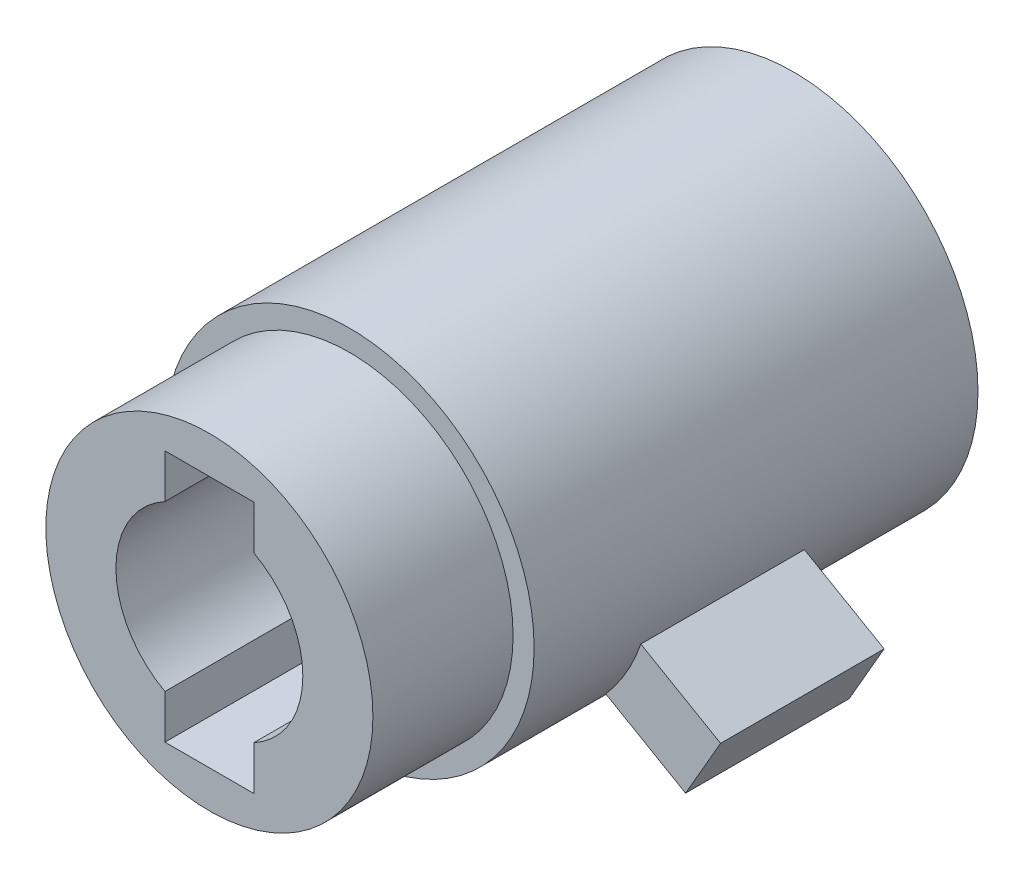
from build123d import *

# Parameters (mm, degrees)
ESQUISSE1_R      = 3.5
EXTRUSION1_DEPTH = 9.2
EXTRUSION2_START = -3
ESQUISSE2_R      = 3.95
ESQUISSE2_R_2    = 2.7
EXTRUSION2_DEPTH = 9.5
EXTRUSION3_START = -2.5
EXTRUSION3_DEPTH = 3.5
EXTRUSION4_DEPTH = 3.1


with BuildPart() as part:
    # Esquisse1 → Extrusion1 (new body)
    with BuildSketch(Plane.XY):
        Circle(ESQUISSE1_R)
        with BuildLine():
            Line((-0.95, 2.7), (0.95, 2.7))
            Line((0.95, 2.7), (0.95, 1.759971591))
            ThreePointArc((0.95, 1.759971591), (2, 0), (0.95, -1.759971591))
            Line((0.95, -1.759971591), (0.95, -2.7))
            Line((0.95, -2.7), (-0.95, -2.7))
            Line((-0.95, -2.7), (-0.95, -1.759971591))
            ThreePointArc((-0.95, -1.759971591), (-2, 0), (-0.95, 1.759971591))
            Line((-0.95, 1.759971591), (-0.95, 2.7))
        make_face(mode=Mode.SUBTRACT)
    extrude(amount=EXTRUSION1_DEPTH)

    # Esquisse2 → Extrusion2 (add)
    with BuildSketch(Plane.XY.offset(9.2).offset(EXTRUSION2_START)):
        Circle(ESQUISSE2_R)
        Circle(ESQUISSE2_R_2, mode=Mode.SUBTRACT)
    extrude(amount=-EXTRUSION2_DEPTH)

    # Esquisse3 → Extrusion3 (add)
    with BuildSketch(Plane.XY.offset(6.2).offset(EXTRUSION3_START)):
        with BuildLine():
            Line((5.441248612, -2.275480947), (3.733571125, -1.28955289))
            ThreePointArc((3.733571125, -1.28955289), (3.420800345, -1.975), (2.983571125, -2.588590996))
            Line((2.983571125, -2.588590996), (4.691248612, -3.574519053))
            Line((4.691248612, -3.574519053), (5.441248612, -2.275480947))
        make_face()
    extrude(amount=-EXTRUSION3_DEPTH)

    # Esquisse4 → Extrusion4 (add)
    with BuildSketch(Plane.XY.offset(6.2)):
        with BuildLine():
            Line((-5.441248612, -2.275480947), (-3.733571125, -1.28955289))
            ThreePointArc((-3.733571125, -1.28955289), (-3.420800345, -1.975), (-2.983571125, -2.588590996))
            Line((-2.983571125, -2.588590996), (-4.691248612, -3.574519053))
            Line((-4.691248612, -3.574519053), (-5.441248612, -2.275480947))
        make_face()
    extrude(amount=-EXTRUSION4_DEPTH)


solid = part.part
